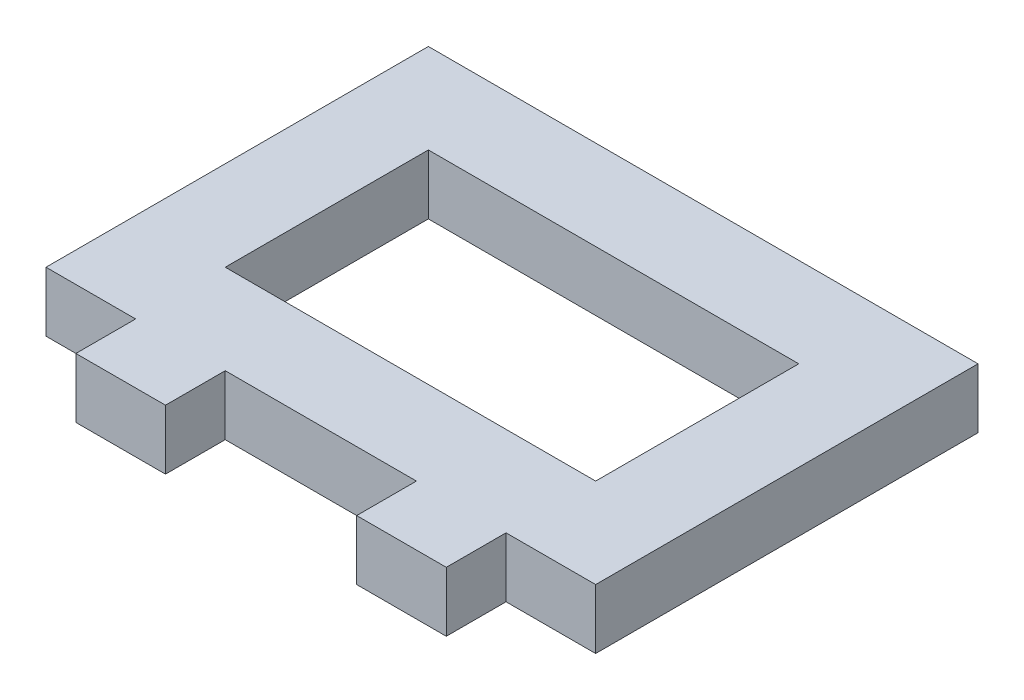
ISO-10303-21;
HEADER;
FILE_DESCRIPTION(('STEP AP214'),'2;1');
FILE_NAME('part.step','',(''),(''),'','','');
FILE_SCHEMA(('AUTOMOTIVE_DESIGN { 1 0 10303 214 1 1 1 1 }'));
ENDSEC;
DATA;
#1=APPLICATION_CONTEXT('core data for automotive mechanical design processes');
#2=APPLICATION_PROTOCOL_DEFINITION('international standard','automotive_design',2000,#1);
#3=PRODUCT_CONTEXT('',#1,'mechanical');
#4=PRODUCT('Part','Part','',(#3));
#5=PRODUCT_RELATED_PRODUCT_CATEGORY('part','',(#4));
#6=PRODUCT_DEFINITION_FORMATION('','',#4);
#7=PRODUCT_DEFINITION_CONTEXT('part definition',#1,'design');
#8=PRODUCT_DEFINITION('design','',#6,#7);
#9=PRODUCT_DEFINITION_SHAPE('','',#8);
#10=(LENGTH_UNIT() NAMED_UNIT(*) SI_UNIT(.MILLI.,.METRE.));
#11=(NAMED_UNIT(*) PLANE_ANGLE_UNIT() SI_UNIT($,.RADIAN.));
#12=(NAMED_UNIT(*) SI_UNIT($,.STERADIAN.) SOLID_ANGLE_UNIT());
#13=UNCERTAINTY_MEASURE_WITH_UNIT(LENGTH_MEASURE(1.E-05),#10,'distance_accuracy_value','');
#14=(GEOMETRIC_REPRESENTATION_CONTEXT(3) GLOBAL_UNCERTAINTY_ASSIGNED_CONTEXT((#13)) GLOBAL_UNIT_ASSIGNED_CONTEXT((#10,
#11,#12)) REPRESENTATION_CONTEXT('',''));
#15=CARTESIAN_POINT('',(0.,0.,0.));
#16=DIRECTION('',(0.,0.,1.));
#17=DIRECTION('',(1.,0.,0.));
#18=AXIS2_PLACEMENT_3D('',#15,#16,#17);
#19=CARTESIAN_POINT('',(0.,5.,0.));
#20=DIRECTION('',(0.,-1.,0.));
#21=DIRECTION('',(0.,0.,-1.));
#22=AXIS2_PLACEMENT_3D('',#19,#20,#21);
#23=PLANE('',#22);
#24=DIRECTION('',(0.,0.,-1.));
#25=VECTOR('',#24,1.);
#26=CARTESIAN_POINT('',(0.,5.,32.));
#27=LINE('',#26,#25);
#28=CARTESIAN_POINT('',(0.,5.,32.));
#29=VERTEX_POINT('',#28);
#30=CARTESIAN_POINT('',(0.,5.,0.));
#31=VERTEX_POINT('',#30);
#32=EDGE_CURVE('E230',#29,#31,#27,.T.);
#33=ORIENTED_EDGE('',*,*,#32,.F.);
#34=DIRECTION('',(-1.,0.,0.));
#35=VECTOR('',#34,1.);
#36=CARTESIAN_POINT('',(7.5,5.,32.));
#37=LINE('',#36,#35);
#38=CARTESIAN_POINT('',(7.5,5.,32.));
#39=VERTEX_POINT('',#38);
#40=EDGE_CURVE('E261',#39,#29,#37,.T.);
#41=ORIENTED_EDGE('',*,*,#40,.F.);
#42=DIRECTION('',(0.,0.,-1.));
#43=VECTOR('',#42,1.);
#44=CARTESIAN_POINT('',(7.5,5.,37.));
#45=LINE('',#44,#43);
#46=CARTESIAN_POINT('',(7.5,5.,37.));
#47=VERTEX_POINT('',#46);
#48=EDGE_CURVE('E258',#47,#39,#45,.T.);
#49=ORIENTED_EDGE('',*,*,#48,.F.);
#50=DIRECTION('',(-1.,0.,0.));
#51=VECTOR('',#50,1.);
#52=CARTESIAN_POINT('',(15.,5.,37.));
#53=LINE('',#52,#51);
#54=CARTESIAN_POINT('',(15.,5.,37.));
#55=VERTEX_POINT('',#54);
#56=EDGE_CURVE('E255',#55,#47,#53,.T.);
#57=ORIENTED_EDGE('',*,*,#56,.F.);
#58=DIRECTION('',(0.,0.,1.));
#59=VECTOR('',#58,1.);
#60=CARTESIAN_POINT('',(15.,5.,32.));
#61=LINE('',#60,#59);
#62=CARTESIAN_POINT('',(15.,5.,32.));
#63=VERTEX_POINT('',#62);
#64=EDGE_CURVE('E252',#63,#55,#61,.T.);
#65=ORIENTED_EDGE('',*,*,#64,.F.);
#66=DIRECTION('',(-1.,0.,0.));
#67=VECTOR('',#66,1.);
#68=CARTESIAN_POINT('',(31.,5.,32.));
#69=LINE('',#68,#67);
#70=CARTESIAN_POINT('',(31.,5.,32.));
#71=VERTEX_POINT('',#70);
#72=EDGE_CURVE('E249',#71,#63,#69,.T.);
#73=ORIENTED_EDGE('',*,*,#72,.F.);
#74=DIRECTION('',(0.,0.,1.));
#75=VECTOR('',#74,1.);
#76=CARTESIAN_POINT('',(31.,5.,32.));
#77=LINE('',#76,#75);
#78=CARTESIAN_POINT('',(31.,5.,37.));
#79=VERTEX_POINT('',#78);
#80=EDGE_CURVE('E247',#71,#79,#77,.T.);
#81=ORIENTED_EDGE('',*,*,#80,.T.);
#82=DIRECTION('',(1.,0.,0.));
#83=VECTOR('',#82,1.);
#84=CARTESIAN_POINT('',(31.,5.,37.));
#85=LINE('',#84,#83);
#86=CARTESIAN_POINT('',(38.5,5.,37.));
#87=VERTEX_POINT('',#86);
#88=EDGE_CURVE('E245',#79,#87,#85,.T.);
#89=ORIENTED_EDGE('',*,*,#88,.T.);
#90=DIRECTION('',(0.,0.,-1.));
#91=VECTOR('',#90,1.);
#92=CARTESIAN_POINT('',(38.5,5.,37.));
#93=LINE('',#92,#91);
#94=CARTESIAN_POINT('',(38.5,5.,32.));
#95=VERTEX_POINT('',#94);
#96=EDGE_CURVE('E243',#87,#95,#93,.T.);
#97=ORIENTED_EDGE('',*,*,#96,.T.);
#98=DIRECTION('',(-1.,0.,0.));
#99=VECTOR('',#98,1.);
#100=CARTESIAN_POINT('',(46.,5.,32.));
#101=LINE('',#100,#99);
#102=CARTESIAN_POINT('',(46.,5.,32.));
#103=VERTEX_POINT('',#102);
#104=EDGE_CURVE('E240',#103,#95,#101,.T.);
#105=ORIENTED_EDGE('',*,*,#104,.F.);
#106=DIRECTION('',(0.,0.,1.));
#107=VECTOR('',#106,1.);
#108=CARTESIAN_POINT('',(46.,5.,0.));
#109=LINE('',#108,#107);
#110=CARTESIAN_POINT('',(46.,5.,0.));
#111=VERTEX_POINT('',#110);
#112=EDGE_CURVE('E237',#111,#103,#109,.T.);
#113=ORIENTED_EDGE('',*,*,#112,.F.);
#114=DIRECTION('',(1.,0.,0.));
#115=VECTOR('',#114,1.);
#116=CARTESIAN_POINT('',(0.,5.,0.));
#117=LINE('',#116,#115);
#118=EDGE_CURVE('E233',#31,#111,#117,.T.);
#119=ORIENTED_EDGE('',*,*,#118,.F.);
#120=EDGE_LOOP('',(#33,#41,#49,#57,#65,#73,#81,#89,#97,#105,#113,#119));
#121=FACE_BOUND('',#120,.T.);
#122=DIRECTION('',(0.,0.,-1.));
#123=VECTOR('',#122,1.);
#124=CARTESIAN_POINT('',(38.5,5.,24.5));
#125=LINE('',#124,#123);
#126=CARTESIAN_POINT('',(38.5,5.,24.5));
#127=VERTEX_POINT('',#126);
#128=CARTESIAN_POINT('',(38.5,5.,7.5));
#129=VERTEX_POINT('',#128);
#130=EDGE_CURVE('E194',#127,#129,#125,.T.);
#131=ORIENTED_EDGE('',*,*,#130,.F.);
#132=DIRECTION('',(1.,0.,0.));
#133=VECTOR('',#132,1.);
#134=CARTESIAN_POINT('',(7.5,5.,24.5));
#135=LINE('',#134,#133);
#136=CARTESIAN_POINT('',(7.5,5.,24.5));
#137=VERTEX_POINT('',#136);
#138=EDGE_CURVE('E216',#137,#127,#135,.T.);
#139=ORIENTED_EDGE('',*,*,#138,.F.);
#140=DIRECTION('',(0.,0.,1.));
#141=VECTOR('',#140,1.);
#142=CARTESIAN_POINT('',(7.5,5.,7.5));
#143=LINE('',#142,#141);
#144=CARTESIAN_POINT('',(7.5,5.,7.5));
#145=VERTEX_POINT('',#144);
#146=EDGE_CURVE('E214',#145,#137,#143,.T.);
#147=ORIENTED_EDGE('',*,*,#146,.F.);
#148=DIRECTION('',(-1.,0.,0.));
#149=VECTOR('',#148,1.);
#150=CARTESIAN_POINT('',(38.5,5.,7.5));
#151=LINE('',#150,#149);
#152=EDGE_CURVE('E202',#129,#145,#151,.T.);
#153=ORIENTED_EDGE('',*,*,#152,.F.);
#154=EDGE_LOOP('',(#131,#139,#147,#153));
#155=FACE_BOUND('',#154,.T.);
#156=ADVANCED_FACE('F80',(#121,#155),#23,.F.);
#157=CARTESIAN_POINT('',(0.,0.,0.));
#158=DIRECTION('',(0.,-1.,0.));
#159=DIRECTION('',(0.,0.,-1.));
#160=AXIS2_PLACEMENT_3D('',#157,#158,#159);
#161=PLANE('',#160);
#162=DIRECTION('',(0.,0.,-1.));
#163=VECTOR('',#162,1.);
#164=CARTESIAN_POINT('',(0.,0.,32.));
#165=LINE('',#164,#163);
#166=CARTESIAN_POINT('',(0.,0.,32.));
#167=VERTEX_POINT('',#166);
#168=CARTESIAN_POINT('',(0.,0.,0.));
#169=VERTEX_POINT('',#168);
#170=EDGE_CURVE('E210',#167,#169,#165,.T.);
#171=ORIENTED_EDGE('',*,*,#170,.T.);
#172=DIRECTION('',(1.,0.,0.));
#173=VECTOR('',#172,1.);
#174=CARTESIAN_POINT('',(0.,0.,0.));
#175=LINE('',#174,#173);
#176=CARTESIAN_POINT('',(46.,0.,0.));
#177=VERTEX_POINT('',#176);
#178=EDGE_CURVE('E266',#169,#177,#175,.T.);
#179=ORIENTED_EDGE('',*,*,#178,.T.);
#180=DIRECTION('',(0.,0.,1.));
#181=VECTOR('',#180,1.);
#182=CARTESIAN_POINT('',(46.,0.,0.));
#183=LINE('',#182,#181);
#184=CARTESIAN_POINT('',(46.,0.,32.));
#185=VERTEX_POINT('',#184);
#186=EDGE_CURVE('E269',#177,#185,#183,.T.);
#187=ORIENTED_EDGE('',*,*,#186,.T.);
#188=DIRECTION('',(-1.,0.,0.));
#189=VECTOR('',#188,1.);
#190=CARTESIAN_POINT('',(46.,0.,32.));
#191=LINE('',#190,#189);
#192=CARTESIAN_POINT('',(38.5,0.,32.));
#193=VERTEX_POINT('',#192);
#194=EDGE_CURVE('E272',#185,#193,#191,.T.);
#195=ORIENTED_EDGE('',*,*,#194,.T.);
#196=DIRECTION('',(0.,0.,-1.));
#197=VECTOR('',#196,1.);
#198=CARTESIAN_POINT('',(38.5,0.,37.));
#199=LINE('',#198,#197);
#200=CARTESIAN_POINT('',(38.5,0.,37.));
#201=VERTEX_POINT('',#200);
#202=EDGE_CURVE('E275',#201,#193,#199,.T.);
#203=ORIENTED_EDGE('',*,*,#202,.F.);
#204=DIRECTION('',(1.,0.,0.));
#205=VECTOR('',#204,1.);
#206=CARTESIAN_POINT('',(31.,0.,37.));
#207=LINE('',#206,#205);
#208=CARTESIAN_POINT('',(31.,0.,37.));
#209=VERTEX_POINT('',#208);
#210=EDGE_CURVE('E278',#209,#201,#207,.T.);
#211=ORIENTED_EDGE('',*,*,#210,.F.);
#212=DIRECTION('',(0.,0.,1.));
#213=VECTOR('',#212,1.);
#214=CARTESIAN_POINT('',(31.,0.,32.));
#215=LINE('',#214,#213);
#216=CARTESIAN_POINT('',(31.,0.,32.));
#217=VERTEX_POINT('',#216);
#218=EDGE_CURVE('E280',#217,#209,#215,.T.);
#219=ORIENTED_EDGE('',*,*,#218,.F.);
#220=DIRECTION('',(-1.,0.,0.));
#221=VECTOR('',#220,1.);
#222=CARTESIAN_POINT('',(31.,0.,32.));
#223=LINE('',#222,#221);
#224=CARTESIAN_POINT('',(15.,0.,32.));
#225=VERTEX_POINT('',#224);
#226=EDGE_CURVE('E282',#217,#225,#223,.T.);
#227=ORIENTED_EDGE('',*,*,#226,.T.);
#228=DIRECTION('',(0.,0.,1.));
#229=VECTOR('',#228,1.);
#230=CARTESIAN_POINT('',(15.,0.,32.));
#231=LINE('',#230,#229);
#232=CARTESIAN_POINT('',(15.,0.,37.));
#233=VERTEX_POINT('',#232);
#234=EDGE_CURVE('E285',#225,#233,#231,.T.);
#235=ORIENTED_EDGE('',*,*,#234,.T.);
#236=DIRECTION('',(-1.,0.,0.));
#237=VECTOR('',#236,1.);
#238=CARTESIAN_POINT('',(15.,0.,37.));
#239=LINE('',#238,#237);
#240=CARTESIAN_POINT('',(7.5,0.,37.));
#241=VERTEX_POINT('',#240);
#242=EDGE_CURVE('E288',#233,#241,#239,.T.);
#243=ORIENTED_EDGE('',*,*,#242,.T.);
#244=DIRECTION('',(0.,0.,-1.));
#245=VECTOR('',#244,1.);
#246=CARTESIAN_POINT('',(7.5,0.,37.));
#247=LINE('',#246,#245);
#248=CARTESIAN_POINT('',(7.5,0.,32.));
#249=VERTEX_POINT('',#248);
#250=EDGE_CURVE('E291',#241,#249,#247,.T.);
#251=ORIENTED_EDGE('',*,*,#250,.T.);
#252=DIRECTION('',(-1.,0.,0.));
#253=VECTOR('',#252,1.);
#254=CARTESIAN_POINT('',(7.5,0.,32.));
#255=LINE('',#254,#253);
#256=EDGE_CURVE('E234',#249,#167,#255,.T.);
#257=ORIENTED_EDGE('',*,*,#256,.T.);
#258=EDGE_LOOP('',(#171,#179,#187,#195,#203,#211,#219,#227,#235,#243,#251,#257));
#259=FACE_BOUND('',#258,.T.);
#260=DIRECTION('',(1.,0.,0.));
#261=VECTOR('',#260,1.);
#262=CARTESIAN_POINT('',(7.5,0.,24.5));
#263=LINE('',#262,#261);
#264=CARTESIAN_POINT('',(7.5,0.,24.5));
#265=VERTEX_POINT('',#264);
#266=CARTESIAN_POINT('',(38.5,0.,24.5));
#267=VERTEX_POINT('',#266);
#268=EDGE_CURVE('E203',#265,#267,#263,.T.);
#269=ORIENTED_EDGE('',*,*,#268,.T.);
#270=DIRECTION('',(0.,0.,-1.));
#271=VECTOR('',#270,1.);
#272=CARTESIAN_POINT('',(38.5,0.,24.5));
#273=LINE('',#272,#271);
#274=CARTESIAN_POINT('',(38.5,0.,7.5));
#275=VERTEX_POINT('',#274);
#276=EDGE_CURVE('E105',#267,#275,#273,.T.);
#277=ORIENTED_EDGE('',*,*,#276,.T.);
#278=DIRECTION('',(-1.,0.,0.));
#279=VECTOR('',#278,1.);
#280=CARTESIAN_POINT('',(38.5,0.,7.5));
#281=LINE('',#280,#279);
#282=CARTESIAN_POINT('',(7.5,0.,7.5));
#283=VERTEX_POINT('',#282);
#284=EDGE_CURVE('E209',#275,#283,#281,.T.);
#285=ORIENTED_EDGE('',*,*,#284,.T.);
#286=DIRECTION('',(0.,0.,1.));
#287=VECTOR('',#286,1.);
#288=CARTESIAN_POINT('',(7.5,0.,7.5));
#289=LINE('',#288,#287);
#290=EDGE_CURVE('E222',#283,#265,#289,.T.);
#291=ORIENTED_EDGE('',*,*,#290,.T.);
#292=EDGE_LOOP('',(#269,#277,#285,#291));
#293=FACE_BOUND('',#292,.T.);
#294=ADVANCED_FACE('F324',(#259,#293),#161,.T.);
#295=CARTESIAN_POINT('',(0.,5.,32.));
#296=DIRECTION('',(-1.,0.,0.));
#297=DIRECTION('',(0.,0.,1.));
#298=AXIS2_PLACEMENT_3D('',#295,#296,#297);
#299=PLANE('',#298);
#300=ORIENTED_EDGE('',*,*,#170,.F.);
#301=DIRECTION('',(0.,-1.,0.));
#302=VECTOR('',#301,1.);
#303=CARTESIAN_POINT('',(0.,5.,32.));
#304=LINE('',#303,#302);
#305=EDGE_CURVE('E12',#29,#167,#304,.T.);
#306=ORIENTED_EDGE('',*,*,#305,.F.);
#307=ORIENTED_EDGE('',*,*,#32,.T.);
#308=DIRECTION('',(0.,-1.,0.));
#309=VECTOR('',#308,1.);
#310=CARTESIAN_POINT('',(0.,5.,0.));
#311=LINE('',#310,#309);
#312=EDGE_CURVE('E84',#31,#169,#311,.T.);
#313=ORIENTED_EDGE('',*,*,#312,.T.);
#314=EDGE_LOOP('',(#300,#306,#307,#313));
#315=FACE_BOUND('',#314,.T.);
#316=ADVANCED_FACE('F82',(#315),#299,.T.);
#317=CARTESIAN_POINT('',(7.5,5.,32.));
#318=DIRECTION('',(0.,0.,1.));
#319=DIRECTION('',(1.,0.,0.));
#320=AXIS2_PLACEMENT_3D('',#317,#318,#319);
#321=PLANE('',#320);
#322=ORIENTED_EDGE('',*,*,#256,.F.);
#323=DIRECTION('',(0.,-1.,0.));
#324=VECTOR('',#323,1.);
#325=CARTESIAN_POINT('',(7.5,5.,32.));
#326=LINE('',#325,#324);
#327=EDGE_CURVE('E89',#39,#249,#326,.T.);
#328=ORIENTED_EDGE('',*,*,#327,.F.);
#329=ORIENTED_EDGE('',*,*,#40,.T.);
#330=ORIENTED_EDGE('',*,*,#305,.T.);
#331=EDGE_LOOP('',(#322,#328,#329,#330));
#332=FACE_BOUND('',#331,.T.);
#333=ADVANCED_FACE('F329',(#332),#321,.T.);
#334=CARTESIAN_POINT('',(7.5,5.,37.));
#335=DIRECTION('',(-1.,0.,0.));
#336=DIRECTION('',(0.,0.,1.));
#337=AXIS2_PLACEMENT_3D('',#334,#335,#336);
#338=PLANE('',#337);
#339=ORIENTED_EDGE('',*,*,#250,.F.);
#340=DIRECTION('',(0.,-1.,0.));
#341=VECTOR('',#340,1.);
#342=CARTESIAN_POINT('',(7.5,5.,37.));
#343=LINE('',#342,#341);
#344=EDGE_CURVE('E297',#47,#241,#343,.T.);
#345=ORIENTED_EDGE('',*,*,#344,.F.);
#346=ORIENTED_EDGE('',*,*,#48,.T.);
#347=ORIENTED_EDGE('',*,*,#327,.T.);
#348=EDGE_LOOP('',(#339,#345,#346,#347));
#349=FACE_BOUND('',#348,.T.);
#350=ADVANCED_FACE('F367',(#349),#338,.T.);
#351=CARTESIAN_POINT('',(15.,5.,37.));
#352=DIRECTION('',(0.,0.,1.));
#353=DIRECTION('',(1.,0.,0.));
#354=AXIS2_PLACEMENT_3D('',#351,#352,#353);
#355=PLANE('',#354);
#356=ORIENTED_EDGE('',*,*,#242,.F.);
#357=DIRECTION('',(0.,-1.,0.));
#358=VECTOR('',#357,1.);
#359=CARTESIAN_POINT('',(15.,5.,37.));
#360=LINE('',#359,#358);
#361=EDGE_CURVE('E299',#55,#233,#360,.T.);
#362=ORIENTED_EDGE('',*,*,#361,.F.);
#363=ORIENTED_EDGE('',*,*,#56,.T.);
#364=ORIENTED_EDGE('',*,*,#344,.T.);
#365=EDGE_LOOP('',(#356,#362,#363,#364));
#366=FACE_BOUND('',#365,.T.);
#367=ADVANCED_FACE('F364',(#366),#355,.T.);
#368=CARTESIAN_POINT('',(15.,5.,32.));
#369=DIRECTION('',(1.,0.,0.));
#370=DIRECTION('',(0.,0.,-1.));
#371=AXIS2_PLACEMENT_3D('',#368,#369,#370);
#372=PLANE('',#371);
#373=ORIENTED_EDGE('',*,*,#234,.F.);
#374=DIRECTION('',(0.,-1.,0.));
#375=VECTOR('',#374,1.);
#376=CARTESIAN_POINT('',(15.,5.,32.));
#377=LINE('',#376,#375);
#378=EDGE_CURVE('E301',#63,#225,#377,.T.);
#379=ORIENTED_EDGE('',*,*,#378,.F.);
#380=ORIENTED_EDGE('',*,*,#64,.T.);
#381=ORIENTED_EDGE('',*,*,#361,.T.);
#382=EDGE_LOOP('',(#373,#379,#380,#381));
#383=FACE_BOUND('',#382,.T.);
#384=ADVANCED_FACE('F361',(#383),#372,.T.);
#385=CARTESIAN_POINT('',(31.,5.,32.));
#386=DIRECTION('',(0.,0.,1.));
#387=DIRECTION('',(1.,0.,0.));
#388=AXIS2_PLACEMENT_3D('',#385,#386,#387);
#389=PLANE('',#388);
#390=ORIENTED_EDGE('',*,*,#226,.F.);
#391=DIRECTION('',(0.,-1.,0.));
#392=VECTOR('',#391,1.);
#393=CARTESIAN_POINT('',(31.,5.,32.));
#394=LINE('',#393,#392);
#395=EDGE_CURVE('E303',#71,#217,#394,.T.);
#396=ORIENTED_EDGE('',*,*,#395,.F.);
#397=ORIENTED_EDGE('',*,*,#72,.T.);
#398=ORIENTED_EDGE('',*,*,#378,.T.);
#399=EDGE_LOOP('',(#390,#396,#397,#398));
#400=FACE_BOUND('',#399,.T.);
#401=ADVANCED_FACE('F355',(#400),#389,.T.);
#402=CARTESIAN_POINT('',(31.,5.,32.));
#403=DIRECTION('',(1.,0.,0.));
#404=DIRECTION('',(0.,0.,-1.));
#405=AXIS2_PLACEMENT_3D('',#402,#403,#404);
#406=PLANE('',#405);
#407=ORIENTED_EDGE('',*,*,#218,.T.);
#408=DIRECTION('',(0.,-1.,0.));
#409=VECTOR('',#408,1.);
#410=CARTESIAN_POINT('',(31.,5.,37.));
#411=LINE('',#410,#409);
#412=EDGE_CURVE('E305',#79,#209,#411,.T.);
#413=ORIENTED_EDGE('',*,*,#412,.F.);
#414=ORIENTED_EDGE('',*,*,#80,.F.);
#415=ORIENTED_EDGE('',*,*,#395,.T.);
#416=EDGE_LOOP('',(#407,#413,#414,#415));
#417=FACE_BOUND('',#416,.T.);
#418=ADVANCED_FACE('F368',(#417),#406,.F.);
#419=CARTESIAN_POINT('',(31.,5.,37.));
#420=DIRECTION('',(0.,0.,-1.));
#421=DIRECTION('',(-1.,0.,0.));
#422=AXIS2_PLACEMENT_3D('',#419,#420,#421);
#423=PLANE('',#422);
#424=ORIENTED_EDGE('',*,*,#210,.T.);
#425=DIRECTION('',(0.,-1.,0.));
#426=VECTOR('',#425,1.);
#427=CARTESIAN_POINT('',(38.5,5.,37.));
#428=LINE('',#427,#426);
#429=EDGE_CURVE('E308',#87,#201,#428,.T.);
#430=ORIENTED_EDGE('',*,*,#429,.F.);
#431=ORIENTED_EDGE('',*,*,#88,.F.);
#432=ORIENTED_EDGE('',*,*,#412,.T.);
#433=EDGE_LOOP('',(#424,#430,#431,#432));
#434=FACE_BOUND('',#433,.T.);
#435=ADVANCED_FACE('F349',(#434),#423,.F.);
#436=CARTESIAN_POINT('',(38.5,5.,37.));
#437=DIRECTION('',(-1.,0.,0.));
#438=DIRECTION('',(0.,0.,1.));
#439=AXIS2_PLACEMENT_3D('',#436,#437,#438);
#440=PLANE('',#439);
#441=ORIENTED_EDGE('',*,*,#202,.T.);
#442=DIRECTION('',(0.,-1.,0.));
#443=VECTOR('',#442,1.);
#444=CARTESIAN_POINT('',(38.5,5.,32.));
#445=LINE('',#444,#443);
#446=EDGE_CURVE('E311',#95,#193,#445,.T.);
#447=ORIENTED_EDGE('',*,*,#446,.F.);
#448=ORIENTED_EDGE('',*,*,#96,.F.);
#449=ORIENTED_EDGE('',*,*,#429,.T.);
#450=EDGE_LOOP('',(#441,#447,#448,#449));
#451=FACE_BOUND('',#450,.T.);
#452=ADVANCED_FACE('F345',(#451),#440,.F.);
#453=CARTESIAN_POINT('',(46.,5.,32.));
#454=DIRECTION('',(0.,0.,1.));
#455=DIRECTION('',(1.,0.,0.));
#456=AXIS2_PLACEMENT_3D('',#453,#454,#455);
#457=PLANE('',#456);
#458=ORIENTED_EDGE('',*,*,#194,.F.);
#459=DIRECTION('',(0.,-1.,0.));
#460=VECTOR('',#459,1.);
#461=CARTESIAN_POINT('',(46.,5.,32.));
#462=LINE('',#461,#460);
#463=EDGE_CURVE('E313',#103,#185,#462,.T.);
#464=ORIENTED_EDGE('',*,*,#463,.F.);
#465=ORIENTED_EDGE('',*,*,#104,.T.);
#466=ORIENTED_EDGE('',*,*,#446,.T.);
#467=EDGE_LOOP('',(#458,#464,#465,#466));
#468=FACE_BOUND('',#467,.T.);
#469=ADVANCED_FACE('F341',(#468),#457,.T.);
#470=CARTESIAN_POINT('',(46.,5.,0.));
#471=DIRECTION('',(1.,0.,0.));
#472=DIRECTION('',(0.,0.,-1.));
#473=AXIS2_PLACEMENT_3D('',#470,#471,#472);
#474=PLANE('',#473);
#475=ORIENTED_EDGE('',*,*,#186,.F.);
#476=DIRECTION('',(0.,-1.,0.));
#477=VECTOR('',#476,1.);
#478=CARTESIAN_POINT('',(46.,5.,0.));
#479=LINE('',#478,#477);
#480=EDGE_CURVE('E314',#111,#177,#479,.T.);
#481=ORIENTED_EDGE('',*,*,#480,.F.);
#482=ORIENTED_EDGE('',*,*,#112,.T.);
#483=ORIENTED_EDGE('',*,*,#463,.T.);
#484=EDGE_LOOP('',(#475,#481,#482,#483));
#485=FACE_BOUND('',#484,.T.);
#486=ADVANCED_FACE('F336',(#485),#474,.T.);
#487=CARTESIAN_POINT('',(0.,5.,0.));
#488=DIRECTION('',(0.,0.,-1.));
#489=DIRECTION('',(-1.,0.,0.));
#490=AXIS2_PLACEMENT_3D('',#487,#488,#489);
#491=PLANE('',#490);
#492=ORIENTED_EDGE('',*,*,#178,.F.);
#493=ORIENTED_EDGE('',*,*,#312,.F.);
#494=ORIENTED_EDGE('',*,*,#118,.T.);
#495=ORIENTED_EDGE('',*,*,#480,.T.);
#496=EDGE_LOOP('',(#492,#493,#494,#495));
#497=FACE_BOUND('',#496,.T.);
#498=ADVANCED_FACE('F322',(#497),#491,.T.);
#499=CARTESIAN_POINT('',(38.5,5.,24.5));
#500=DIRECTION('',(-1.,0.,0.));
#501=DIRECTION('',(0.,0.,1.));
#502=AXIS2_PLACEMENT_3D('',#499,#500,#501);
#503=PLANE('',#502);
#504=ORIENTED_EDGE('',*,*,#276,.F.);
#505=DIRECTION('',(0.,-1.,0.));
#506=VECTOR('',#505,1.);
#507=CARTESIAN_POINT('',(38.5,5.,24.5));
#508=LINE('',#507,#506);
#509=EDGE_CURVE('E198',#127,#267,#508,.T.);
#510=ORIENTED_EDGE('',*,*,#509,.F.);
#511=ORIENTED_EDGE('',*,*,#130,.T.);
#512=DIRECTION('',(0.,-1.,0.));
#513=VECTOR('',#512,1.);
#514=CARTESIAN_POINT('',(38.5,5.,7.5));
#515=LINE('',#514,#513);
#516=EDGE_CURVE('E197',#129,#275,#515,.T.);
#517=ORIENTED_EDGE('',*,*,#516,.T.);
#518=EDGE_LOOP('',(#504,#510,#511,#517));
#519=FACE_BOUND('',#518,.T.);
#520=ADVANCED_FACE('F196',(#519),#503,.T.);
#521=CARTESIAN_POINT('',(38.5,5.,7.5));
#522=DIRECTION('',(0.,0.,1.));
#523=DIRECTION('',(1.,0.,0.));
#524=AXIS2_PLACEMENT_3D('',#521,#522,#523);
#525=PLANE('',#524);
#526=ORIENTED_EDGE('',*,*,#284,.F.);
#527=ORIENTED_EDGE('',*,*,#516,.F.);
#528=ORIENTED_EDGE('',*,*,#152,.T.);
#529=DIRECTION('',(0.,-1.,0.));
#530=VECTOR('',#529,1.);
#531=CARTESIAN_POINT('',(7.5,5.,7.5));
#532=LINE('',#531,#530);
#533=EDGE_CURVE('E211',#145,#283,#532,.T.);
#534=ORIENTED_EDGE('',*,*,#533,.T.);
#535=EDGE_LOOP('',(#526,#527,#528,#534));
#536=FACE_BOUND('',#535,.T.);
#537=ADVANCED_FACE('F206',(#536),#525,.T.);
#538=CARTESIAN_POINT('',(7.5,5.,7.5));
#539=DIRECTION('',(1.,0.,0.));
#540=DIRECTION('',(0.,0.,-1.));
#541=AXIS2_PLACEMENT_3D('',#538,#539,#540);
#542=PLANE('',#541);
#543=ORIENTED_EDGE('',*,*,#290,.F.);
#544=ORIENTED_EDGE('',*,*,#533,.F.);
#545=ORIENTED_EDGE('',*,*,#146,.T.);
#546=DIRECTION('',(0.,-1.,0.));
#547=VECTOR('',#546,1.);
#548=CARTESIAN_POINT('',(7.5,5.,24.5));
#549=LINE('',#548,#547);
#550=EDGE_CURVE('E97',#137,#265,#549,.T.);
#551=ORIENTED_EDGE('',*,*,#550,.T.);
#552=EDGE_LOOP('',(#543,#544,#545,#551));
#553=FACE_BOUND('',#552,.T.);
#554=ADVANCED_FACE('F458',(#553),#542,.T.);
#555=CARTESIAN_POINT('',(7.5,5.,24.5));
#556=DIRECTION('',(0.,0.,-1.));
#557=DIRECTION('',(-1.,0.,0.));
#558=AXIS2_PLACEMENT_3D('',#555,#556,#557);
#559=PLANE('',#558);
#560=ORIENTED_EDGE('',*,*,#268,.F.);
#561=ORIENTED_EDGE('',*,*,#550,.F.);
#562=ORIENTED_EDGE('',*,*,#138,.T.);
#563=ORIENTED_EDGE('',*,*,#509,.T.);
#564=EDGE_LOOP('',(#560,#561,#562,#563));
#565=FACE_BOUND('',#564,.T.);
#566=ADVANCED_FACE('F466',(#565),#559,.T.);
#567=CLOSED_SHELL('',(#156,#294,#316,#333,#350,#367,#384,#401,#418,#435,#452,#469,#486,#498,
#520,#537,#554,#566));
#568=MANIFOLD_SOLID_BREP('B2',#567);
#569=ADVANCED_BREP_SHAPE_REPRESENTATION('',(#18,#568),#14);
#570=SHAPE_DEFINITION_REPRESENTATION(#9,#569);
ENDSEC;
END-ISO-10303-21;
